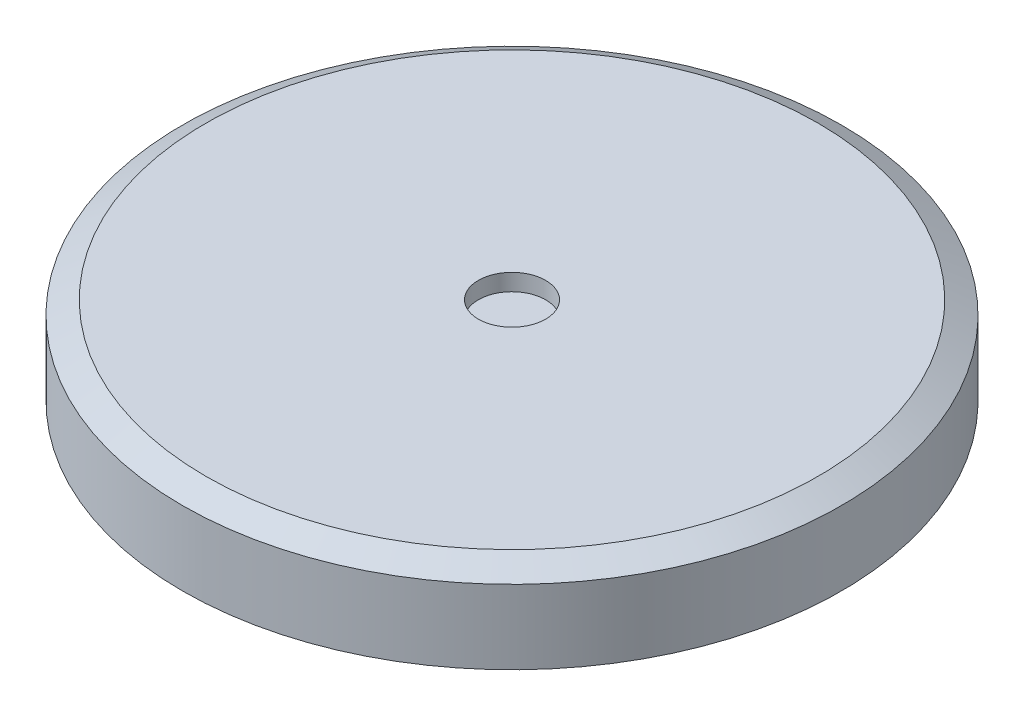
ISO-10303-21;
HEADER;
FILE_DESCRIPTION(('STEP AP214'),'2;1');
FILE_NAME('part.step','',(''),(''),'','','');
FILE_SCHEMA(('AUTOMOTIVE_DESIGN { 1 0 10303 214 1 1 1 1 }'));
ENDSEC;
DATA;
#1=APPLICATION_CONTEXT('core data for automotive mechanical design processes');
#2=APPLICATION_PROTOCOL_DEFINITION('international standard','automotive_design',2000,#1);
#3=PRODUCT_CONTEXT('',#1,'mechanical');
#4=PRODUCT('Part','Part','',(#3));
#5=PRODUCT_RELATED_PRODUCT_CATEGORY('part','',(#4));
#6=PRODUCT_DEFINITION_FORMATION('','',#4);
#7=PRODUCT_DEFINITION_CONTEXT('part definition',#1,'design');
#8=PRODUCT_DEFINITION('design','',#6,#7);
#9=PRODUCT_DEFINITION_SHAPE('','',#8);
#10=(LENGTH_UNIT() NAMED_UNIT(*) SI_UNIT(.MILLI.,.METRE.));
#11=(NAMED_UNIT(*) PLANE_ANGLE_UNIT() SI_UNIT($,.RADIAN.));
#12=(NAMED_UNIT(*) SI_UNIT($,.STERADIAN.) SOLID_ANGLE_UNIT());
#13=UNCERTAINTY_MEASURE_WITH_UNIT(LENGTH_MEASURE(1.E-05),#10,'distance_accuracy_value','');
#14=(GEOMETRIC_REPRESENTATION_CONTEXT(3) GLOBAL_UNCERTAINTY_ASSIGNED_CONTEXT((#13)) GLOBAL_UNIT_ASSIGNED_CONTEXT((#10,
#11,#12)) REPRESENTATION_CONTEXT('',''));
#15=CARTESIAN_POINT('',(0.,0.,0.));
#16=DIRECTION('',(0.,0.,1.));
#17=DIRECTION('',(1.,0.,0.));
#18=AXIS2_PLACEMENT_3D('',#15,#16,#17);
#19=CARTESIAN_POINT('',(0.,3.,0.));
#20=DIRECTION('',(0.,-1.,0.));
#21=DIRECTION('',(0.,0.,-1.));
#22=AXIS2_PLACEMENT_3D('',#19,#20,#21);
#23=CYLINDRICAL_SURFACE('',#22,9.8);
#24=CARTESIAN_POINT('',(0.,0.400000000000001,0.));
#25=DIRECTION('',(0.,1.,0.));
#26=DIRECTION('',(0.,0.,1.));
#27=AXIS2_PLACEMENT_3D('',#24,#25,#26);
#28=CIRCLE('',#27,9.8);
#29=CARTESIAN_POINT('',(0.,0.400000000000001,9.8));
#30=VERTEX_POINT('',#29);
#31=EDGE_CURVE('E35',#30,#30,#28,.T.);
#32=ORIENTED_EDGE('',*,*,#31,.T.);
#33=EDGE_LOOP('',(#32));
#34=FACE_BOUND('',#33,.T.);
#35=CARTESIAN_POINT('',(0.,2.6,0.));
#36=DIRECTION('',(0.,1.,0.));
#37=DIRECTION('',(0.,0.,1.));
#38=AXIS2_PLACEMENT_3D('',#35,#36,#37);
#39=CIRCLE('',#38,9.8);
#40=CARTESIAN_POINT('',(0.,2.6,9.8));
#41=VERTEX_POINT('',#40);
#42=EDGE_CURVE('E39',#41,#41,#39,.F.);
#43=ORIENTED_EDGE('',*,*,#42,.T.);
#44=EDGE_LOOP('',(#43));
#45=FACE_BOUND('',#44,.T.);
#46=ADVANCED_FACE('F29',(#34,#45),#23,.T.);
#47=CARTESIAN_POINT('',(0.,3.,0.));
#48=DIRECTION('',(0.,1.,0.));
#49=DIRECTION('',(0.,0.,1.));
#50=AXIS2_PLACEMENT_3D('',#47,#48,#49);
#51=PLANE('',#50);
#52=CARTESIAN_POINT('',(0.,3.,0.));
#53=DIRECTION('',(0.,1.,0.));
#54=DIRECTION('',(0.,0.,1.));
#55=AXIS2_PLACEMENT_3D('',#52,#53,#54);
#56=CIRCLE('',#55,9.1);
#57=CARTESIAN_POINT('',(0.,3.,9.1));
#58=VERTEX_POINT('',#57);
#59=EDGE_CURVE('E43',#58,#58,#56,.T.);
#60=ORIENTED_EDGE('',*,*,#59,.T.);
#61=EDGE_LOOP('',(#60));
#62=FACE_BOUND('',#61,.T.);
#63=CARTESIAN_POINT('',(0.,3.,0.));
#64=DIRECTION('',(0.,1.,0.));
#65=DIRECTION('',(0.,0.,1.));
#66=AXIS2_PLACEMENT_3D('',#63,#64,#65);
#67=CIRCLE('',#66,1.);
#68=CARTESIAN_POINT('',(0.,3.,1.));
#69=VERTEX_POINT('',#68);
#70=EDGE_CURVE('E51',#69,#69,#67,.T.);
#71=ORIENTED_EDGE('',*,*,#70,.F.);
#72=EDGE_LOOP('',(#71));
#73=FACE_BOUND('',#72,.T.);
#74=ADVANCED_FACE('F57',(#62,#73),#51,.T.);
#75=CARTESIAN_POINT('',(0.,0.,0.));
#76=DIRECTION('',(0.,1.,0.));
#77=DIRECTION('',(0.,0.,1.));
#78=AXIS2_PLACEMENT_3D('',#75,#76,#77);
#79=PLANE('',#78);
#80=CARTESIAN_POINT('',(0.,0.,0.));
#81=DIRECTION('',(0.,1.,0.));
#82=DIRECTION('',(0.,0.,1.));
#83=AXIS2_PLACEMENT_3D('',#80,#81,#82);
#84=CIRCLE('',#83,9.1);
#85=CARTESIAN_POINT('',(0.,0.,9.1));
#86=VERTEX_POINT('',#85);
#87=EDGE_CURVE('E10',#86,#86,#84,.F.);
#88=ORIENTED_EDGE('',*,*,#87,.T.);
#89=EDGE_LOOP('',(#88));
#90=FACE_BOUND('',#89,.T.);
#91=ADVANCED_FACE('F59',(#90),#79,.F.);
#92=CARTESIAN_POINT('',(0.,2.5,0.));
#93=DIRECTION('',(0.,1.,0.));
#94=DIRECTION('',(0.,0.,1.));
#95=AXIS2_PLACEMENT_3D('',#92,#93,#94);
#96=CYLINDRICAL_SURFACE('',#95,1.);
#97=CARTESIAN_POINT('',(0.,2.5,0.));
#98=DIRECTION('',(0.,1.,0.));
#99=DIRECTION('',(0.,0.,1.));
#100=AXIS2_PLACEMENT_3D('',#97,#98,#99);
#101=CIRCLE('',#100,1.);
#102=CARTESIAN_POINT('',(0.,2.5,1.));
#103=VERTEX_POINT('',#102);
#104=EDGE_CURVE('E48',#103,#103,#101,.T.);
#105=ORIENTED_EDGE('',*,*,#104,.F.);
#106=EDGE_LOOP('',(#105));
#107=FACE_BOUND('',#106,.T.);
#108=ORIENTED_EDGE('',*,*,#70,.T.);
#109=EDGE_LOOP('',(#108));
#110=FACE_BOUND('',#109,.T.);
#111=ADVANCED_FACE('F55',(#107,#110),#96,.F.);
#112=CARTESIAN_POINT('',(0.,2.5,0.));
#113=DIRECTION('',(0.,1.,0.));
#114=DIRECTION('',(0.,0.,1.));
#115=AXIS2_PLACEMENT_3D('',#112,#113,#114);
#116=PLANE('',#115);
#117=ORIENTED_EDGE('',*,*,#104,.T.);
#118=EDGE_LOOP('',(#117));
#119=FACE_BOUND('',#118,.T.);
#120=ADVANCED_FACE('F69',(#119),#116,.T.);
#121=CARTESIAN_POINT('',(0.,3.,0.));
#122=DIRECTION('',(0.,-1.,0.));
#123=DIRECTION('',(0.,0.,-1.));
#124=AXIS2_PLACEMENT_3D('',#121,#122,#123);
#125=CONICAL_SURFACE('',#124,9.1,1.05165021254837);
#126=ORIENTED_EDGE('',*,*,#42,.F.);
#127=EDGE_LOOP('',(#126));
#128=FACE_BOUND('',#127,.T.);
#129=ORIENTED_EDGE('',*,*,#59,.F.);
#130=EDGE_LOOP('',(#129));
#131=FACE_BOUND('',#130,.T.);
#132=ADVANCED_FACE('F73',(#128,#131),#125,.T.);
#133=CARTESIAN_POINT('',(0.,0.400000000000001,0.));
#134=DIRECTION('',(0.,1.,0.));
#135=DIRECTION('',(0.,0.,1.));
#136=AXIS2_PLACEMENT_3D('',#133,#134,#135);
#137=CONICAL_SURFACE('',#136,9.8,1.05165021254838);
#138=ORIENTED_EDGE('',*,*,#87,.F.);
#139=EDGE_LOOP('',(#138));
#140=FACE_BOUND('',#139,.T.);
#141=ORIENTED_EDGE('',*,*,#31,.F.);
#142=EDGE_LOOP('',(#141));
#143=FACE_BOUND('',#142,.T.);
#144=ADVANCED_FACE('F77',(#140,#143),#137,.T.);
#145=CLOSED_SHELL('',(#46,#74,#91,#111,#120,#132,#144));
#146=MANIFOLD_SOLID_BREP('B2',#145);
#147=ADVANCED_BREP_SHAPE_REPRESENTATION('',(#18,#146),#14);
#148=SHAPE_DEFINITION_REPRESENTATION(#9,#147);
ENDSEC;
END-ISO-10303-21;
